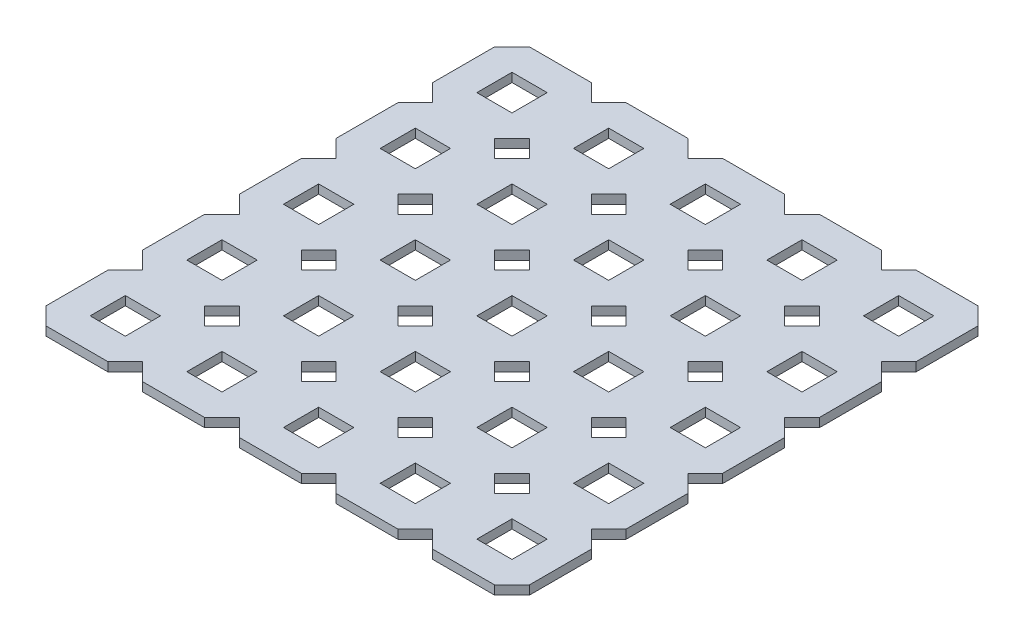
from build123d import *

# Parameters (mm, degrees)
SKETCH1_W           = 4.6228
SKETCH1_H           = 4.6228
BOSS_EXTRUDE1_DEPTH = 1.1684
SKETCH2_W           = 63.5
SKETCH2_H           = 63.5
CUT_EXTRUDE1_DEPTH  = 2.54


with BuildPart() as part:
    # Sketch1 → Boss-Extrude1 (new body)
    with BuildSketch(Plane(origin=(0, 1.1684, 0), x_dir=(1, 0, 0), z_dir=(0, 1, 0))):
        Polygon((14.980985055, 127), (12.7, 124.719014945), (10.419014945, 127), (2.280985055, 127), (0, 124.719014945), (0, 116.580985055), (2.280985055, 114.3), (0, 112.019014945), (0, 103.880985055), (2.280985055, 101.6), (0, 99.319014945), (0, 91.180985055), (2.280985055, 88.9), (0, 86.619014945), (0, 78.480985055), (2.280985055, 76.2), (0, 73.919014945), (0, 65.780985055), (2.280985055, 63.5), (0, 61.219014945), (0, 53.080985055), (2.280985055, 50.8), (0, 48.519014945), (0, 40.380985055), (2.280985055, 38.1), (0, 35.819014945), (0, 27.680985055), (2.280985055, 25.4), (0, 23.119014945), (0, 14.980985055), (2.280985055, 12.7), (0, 10.419014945), (0, 2.280985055), (2.280985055, 0), (10.419014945, 0), (12.7, 2.280985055), (14.980985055, 0), (23.119014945, 0), (25.4, 2.280985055), (27.680985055, 0), (35.819014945, 0), (38.1, 2.280985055), (40.380985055, 0), (48.519014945, 0), (50.8, 2.280985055), (53.080985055, 0), (61.219014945, 0), (63.5, 2.280985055), (63.5, 10.419014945), (61.219014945, 12.7), (63.5, 14.980985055), (63.5, 23.119014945), (61.219014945, 25.4), (63.5, 27.680985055), (63.5, 35.819014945), (61.219014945, 38.1), (63.5, 40.380985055), (63.5, 48.519014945), (61.219014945, 50.8), (63.5, 53.080985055), (63.5, 61.219014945), (61.219014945, 63.5), (63.5, 65.780985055), (63.5, 73.919014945), (61.219014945, 76.2), (63.5, 78.480985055), (63.5, 86.619014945), (61.219014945, 88.9), (63.5, 91.180985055), (63.5, 99.319014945), (61.219014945, 101.6), (63.5, 103.880985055), (63.5, 112.019014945), (61.219014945, 114.3), (63.5, 116.580985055), (63.5, 124.719014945), (61.219014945, 127), (53.080985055, 127), (50.8, 124.719014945), (48.519014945, 127), (40.380985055, 127), (38.1, 124.719014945), (35.819014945, 127), (27.680985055, 127), (25.4, 124.719014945), (23.119014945, 127), align=None)
        Polygon((12.7, 112.019014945), (10.419014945, 114.3), (12.7, 116.580985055), (14.980985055, 114.3), align=None, mode=Mode.SUBTRACT)
        Polygon((12.7, 86.619014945), (10.419014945, 88.9), (12.7, 91.180985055), (14.980985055, 88.9), align=None, mode=Mode.SUBTRACT)
        Polygon((12.7, 61.219014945), (10.419014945, 63.5), (12.7, 65.780985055), (14.980985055, 63.5), align=None, mode=Mode.SUBTRACT)
        Polygon((12.7, 35.819014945), (10.419014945, 38.1), (12.7, 40.380985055), (14.980985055, 38.1), align=None, mode=Mode.SUBTRACT)
        Polygon((12.7, 10.419014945), (10.419014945, 12.7), (12.7, 14.980985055), (14.980985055, 12.7), align=None, mode=Mode.SUBTRACT)
        Polygon((25.4, 112.019014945), (23.119014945, 114.3), (25.4, 116.580985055), (27.680985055, 114.3), align=None, mode=Mode.SUBTRACT)
        Polygon((25.4, 86.619014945), (23.119014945, 88.9), (25.4, 91.180985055), (27.680985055, 88.9), align=None, mode=Mode.SUBTRACT)
        Polygon((25.4, 61.219014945), (23.119014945, 63.5), (25.4, 65.780985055), (27.680985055, 63.5), align=None, mode=Mode.SUBTRACT)
        Polygon((25.4, 35.819014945), (23.119014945, 38.1), (25.4, 40.380985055), (27.680985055, 38.1), align=None, mode=Mode.SUBTRACT)
        Polygon((25.4, 10.419014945), (23.119014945, 12.7), (25.4, 14.980985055), (27.680985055, 12.7), align=None, mode=Mode.SUBTRACT)
        Polygon((38.1, 112.019014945), (35.819014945, 114.3), (38.1, 116.580985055), (40.380985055, 114.3), align=None, mode=Mode.SUBTRACT)
        Polygon((38.1, 86.619014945), (35.819014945, 88.9), (38.1, 91.180985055), (40.380985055, 88.9), align=None, mode=Mode.SUBTRACT)
        Polygon((38.1, 61.219014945), (35.819014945, 63.5), (38.1, 65.780985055), (40.380985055, 63.5), align=None, mode=Mode.SUBTRACT)
        Polygon((38.1, 35.819014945), (35.819014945, 38.1), (38.1, 40.380985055), (40.380985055, 38.1), align=None, mode=Mode.SUBTRACT)
        Polygon((38.1, 10.419014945), (35.819014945, 12.7), (38.1, 14.980985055), (40.380985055, 12.7), align=None, mode=Mode.SUBTRACT)
        Polygon((50.8, 112.019014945), (48.519014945, 114.3), (50.8, 116.580985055), (53.080985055, 114.3), align=None, mode=Mode.SUBTRACT)
        Polygon((50.8, 86.619014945), (48.519014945, 88.9), (50.8, 91.180985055), (53.080985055, 88.9), align=None, mode=Mode.SUBTRACT)
        Polygon((50.8, 61.219014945), (48.519014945, 63.5), (50.8, 65.780985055), (53.080985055, 63.5), align=None, mode=Mode.SUBTRACT)
        Polygon((50.8, 35.819014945), (48.519014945, 38.1), (50.8, 40.380985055), (53.080985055, 38.1), align=None, mode=Mode.SUBTRACT)
        Polygon((50.8, 10.419014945), (48.519014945, 12.7), (50.8, 14.980985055), (53.080985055, 12.7), align=None, mode=Mode.SUBTRACT)
        with Locations((6.35, 120.65)):
            Rectangle(SKETCH1_W, SKETCH1_H, mode=Mode.SUBTRACT)
        with Locations((19.05, 120.65)):
            Rectangle(SKETCH1_W, SKETCH1_H, mode=Mode.SUBTRACT)
        with Locations((31.75, 120.65)):
            Rectangle(SKETCH1_W, SKETCH1_H, mode=Mode.SUBTRACT)
        with Locations((44.45, 120.65)):
            Rectangle(SKETCH1_W, SKETCH1_H, mode=Mode.SUBTRACT)
        with Locations((57.15, 120.65)):
            Rectangle(SKETCH1_W, SKETCH1_H, mode=Mode.SUBTRACT)
        with Locations((6.35, 107.95)):
            Rectangle(SKETCH1_W, SKETCH1_H, mode=Mode.SUBTRACT)
        with Locations((57.15, 107.95)):
            Rectangle(SKETCH1_W, SKETCH1_H, mode=Mode.SUBTRACT)
        with Locations((6.35, 95.25)):
            Rectangle(SKETCH1_W, SKETCH1_H, mode=Mode.SUBTRACT)
        with Locations((57.15, 95.25)):
            Rectangle(SKETCH1_W, SKETCH1_H, mode=Mode.SUBTRACT)
        with Locations((6.35, 82.55)):
            Rectangle(SKETCH1_W, SKETCH1_H, mode=Mode.SUBTRACT)
        with Locations((57.15, 82.55)):
            Rectangle(SKETCH1_W, SKETCH1_H, mode=Mode.SUBTRACT)
        with Locations((6.35, 69.85)):
            Rectangle(SKETCH1_W, SKETCH1_H, mode=Mode.SUBTRACT)
        with Locations((57.15, 69.85)):
            Rectangle(SKETCH1_W, SKETCH1_H, mode=Mode.SUBTRACT)
        with Locations((6.35, 57.15)):
            Rectangle(SKETCH1_W, SKETCH1_H, mode=Mode.SUBTRACT)
        with Locations((57.15, 57.15)):
            Rectangle(SKETCH1_W, SKETCH1_H, mode=Mode.SUBTRACT)
        with Locations((6.35, 44.45)):
            Rectangle(SKETCH1_W, SKETCH1_H, mode=Mode.SUBTRACT)
        with Locations((57.15, 44.45)):
            Rectangle(SKETCH1_W, SKETCH1_H, mode=Mode.SUBTRACT)
        with Locations((6.35, 31.75)):
            Rectangle(SKETCH1_W, SKETCH1_H, mode=Mode.SUBTRACT)
        with Locations((57.15, 31.75)):
            Rectangle(SKETCH1_W, SKETCH1_H, mode=Mode.SUBTRACT)
        with Locations((6.35, 19.05)):
            Rectangle(SKETCH1_W, SKETCH1_H, mode=Mode.SUBTRACT)
        with Locations((57.15, 19.05)):
            Rectangle(SKETCH1_W, SKETCH1_H, mode=Mode.SUBTRACT)
        with Locations((6.35, 6.35)):
            Rectangle(SKETCH1_W, SKETCH1_H, mode=Mode.SUBTRACT)
        with Locations((19.05, 6.35)):
            Rectangle(SKETCH1_W, SKETCH1_H, mode=Mode.SUBTRACT)
        with Locations((31.75, 6.35)):
            Rectangle(SKETCH1_W, SKETCH1_H, mode=Mode.SUBTRACT)
        with Locations((19.05, 107.95)):
            Rectangle(SKETCH1_W, SKETCH1_H, mode=Mode.SUBTRACT)
        with Locations((31.75, 107.95)):
            Rectangle(SKETCH1_W, SKETCH1_H, mode=Mode.SUBTRACT)
        with Locations((44.45, 107.95)):
            Rectangle(SKETCH1_W, SKETCH1_H, mode=Mode.SUBTRACT)
        with Locations((19.05, 95.25)):
            Rectangle(SKETCH1_W, SKETCH1_H, mode=Mode.SUBTRACT)
        with Locations((31.75, 95.25)):
            Rectangle(SKETCH1_W, SKETCH1_H, mode=Mode.SUBTRACT)
        with Locations((44.45, 95.25)):
            Rectangle(SKETCH1_W, SKETCH1_H, mode=Mode.SUBTRACT)
        with Locations((19.05, 82.55)):
            Rectangle(SKETCH1_W, SKETCH1_H, mode=Mode.SUBTRACT)
        with Locations((31.75, 82.55)):
            Rectangle(SKETCH1_W, SKETCH1_H, mode=Mode.SUBTRACT)
        with Locations((44.45, 82.55)):
            Rectangle(SKETCH1_W, SKETCH1_H, mode=Mode.SUBTRACT)
        with Locations((19.05, 69.85)):
            Rectangle(SKETCH1_W, SKETCH1_H, mode=Mode.SUBTRACT)
        with Locations((31.75, 69.85)):
            Rectangle(SKETCH1_W, SKETCH1_H, mode=Mode.SUBTRACT)
        with Locations((44.45, 69.85)):
            Rectangle(SKETCH1_W, SKETCH1_H, mode=Mode.SUBTRACT)
        with Locations((19.05, 57.15)):
            Rectangle(SKETCH1_W, SKETCH1_H, mode=Mode.SUBTRACT)
        with Locations((31.75, 57.15)):
            Rectangle(SKETCH1_W, SKETCH1_H, mode=Mode.SUBTRACT)
        with Locations((44.45, 57.15)):
            Rectangle(SKETCH1_W, SKETCH1_H, mode=Mode.SUBTRACT)
        with Locations((19.05, 44.45)):
            Rectangle(SKETCH1_W, SKETCH1_H, mode=Mode.SUBTRACT)
        with Locations((31.75, 44.45)):
            Rectangle(SKETCH1_W, SKETCH1_H, mode=Mode.SUBTRACT)
        with Locations((44.45, 44.45)):
            Rectangle(SKETCH1_W, SKETCH1_H, mode=Mode.SUBTRACT)
        with Locations((19.05, 31.75)):
            Rectangle(SKETCH1_W, SKETCH1_H, mode=Mode.SUBTRACT)
        with Locations((31.75, 31.75)):
            Rectangle(SKETCH1_W, SKETCH1_H, mode=Mode.SUBTRACT)
        with Locations((44.45, 31.75)):
            Rectangle(SKETCH1_W, SKETCH1_H, mode=Mode.SUBTRACT)
        with Locations((19.05, 19.05)):
            Rectangle(SKETCH1_W, SKETCH1_H, mode=Mode.SUBTRACT)
        with Locations((31.75, 19.05)):
            Rectangle(SKETCH1_W, SKETCH1_H, mode=Mode.SUBTRACT)
        with Locations((57.15, 6.35)):
            Rectangle(SKETCH1_W, SKETCH1_H, mode=Mode.SUBTRACT)
        with Locations((44.45, 19.05)):
            Rectangle(SKETCH1_W, SKETCH1_H, mode=Mode.SUBTRACT)
        with Locations((44.45, 6.35)):
            Rectangle(SKETCH1_W, SKETCH1_H, mode=Mode.SUBTRACT)
        Polygon((50.8, 23.119014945), (48.519014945, 25.4), (50.8, 27.680985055), (53.080985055, 25.4), align=None, mode=Mode.SUBTRACT)
        Polygon((50.8, 48.519014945), (48.519014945, 50.8), (50.8, 53.080985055), (53.080985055, 50.8), align=None, mode=Mode.SUBTRACT)
        Polygon((50.8, 73.919014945), (48.519014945, 76.2), (50.8, 78.480985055), (53.080985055, 76.2), align=None, mode=Mode.SUBTRACT)
        Polygon((50.8, 99.319014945), (48.519014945, 101.6), (50.8, 103.880985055), (53.080985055, 101.6), align=None, mode=Mode.SUBTRACT)
        Polygon((38.1, 23.119014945), (35.819014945, 25.4), (38.1, 27.680985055), (40.380985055, 25.4), align=None, mode=Mode.SUBTRACT)
        Polygon((38.1, 48.519014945), (35.819014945, 50.8), (38.1, 53.080985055), (40.380985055, 50.8), align=None, mode=Mode.SUBTRACT)
        Polygon((38.1, 73.919014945), (35.819014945, 76.2), (38.1, 78.480985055), (40.380985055, 76.2), align=None, mode=Mode.SUBTRACT)
        Polygon((38.1, 99.319014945), (35.819014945, 101.6), (38.1, 103.880985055), (40.380985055, 101.6), align=None, mode=Mode.SUBTRACT)
        Polygon((25.4, 23.119014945), (23.119014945, 25.4), (25.4, 27.680985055), (27.680985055, 25.4), align=None, mode=Mode.SUBTRACT)
        Polygon((25.4, 48.519014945), (23.119014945, 50.8), (25.4, 53.080985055), (27.680985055, 50.8), align=None, mode=Mode.SUBTRACT)
        Polygon((25.4, 73.919014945), (23.119014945, 76.2), (25.4, 78.480985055), (27.680985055, 76.2), align=None, mode=Mode.SUBTRACT)
        Polygon((25.4, 99.319014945), (23.119014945, 101.6), (25.4, 103.880985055), (27.680985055, 101.6), align=None, mode=Mode.SUBTRACT)
        Polygon((12.7, 23.119014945), (10.419014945, 25.4), (12.7, 27.680985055), (14.980985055, 25.4), align=None, mode=Mode.SUBTRACT)
        Polygon((12.7, 48.519014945), (10.419014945, 50.8), (12.7, 53.080985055), (14.980985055, 50.8), align=None, mode=Mode.SUBTRACT)
        Polygon((12.7, 73.919014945), (10.419014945, 76.2), (12.7, 78.480985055), (14.980985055, 76.2), align=None, mode=Mode.SUBTRACT)
        Polygon((12.7, 99.319014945), (10.419014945, 101.6), (12.7, 103.880985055), (14.980985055, 101.6), align=None, mode=Mode.SUBTRACT)
    extrude(amount=-BOSS_EXTRUDE1_DEPTH)

    # Sketch2 → Cut-Extrude1 (cut)
    with BuildSketch(Plane(origin=(0, 1.1684, 0), x_dir=(1, 0, 0), z_dir=(0, 1, 0))):
        with Locations((31.75, 95.25)):
            Rectangle(SKETCH2_W, SKETCH2_H)
    extrude(amount=-CUT_EXTRUDE1_DEPTH, mode=Mode.SUBTRACT)


solid = part.part
